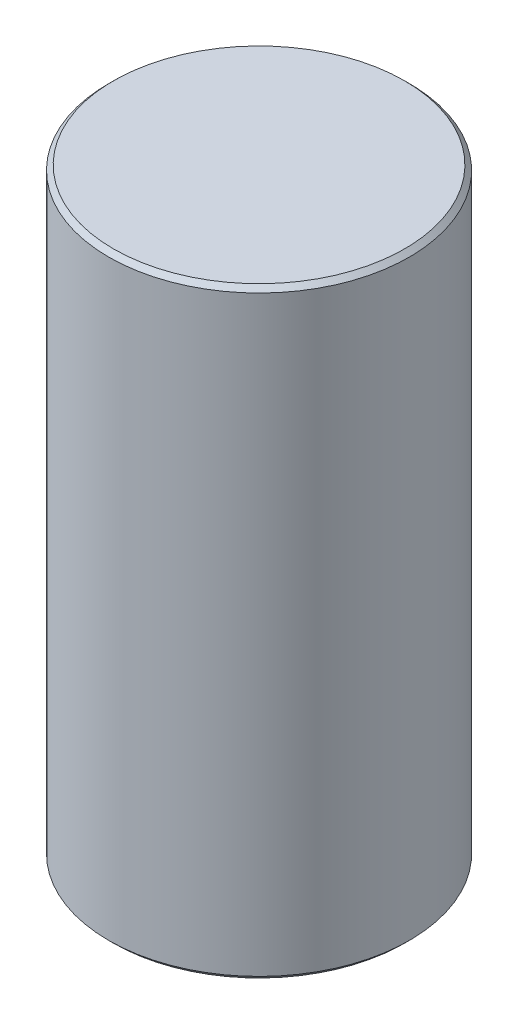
ISO-10303-21;
HEADER;
FILE_DESCRIPTION(('STEP AP214'),'2;1');
FILE_NAME('part.step','',(''),(''),'','','');
FILE_SCHEMA(('AUTOMOTIVE_DESIGN { 1 0 10303 214 1 1 1 1 }'));
ENDSEC;
DATA;
#1=APPLICATION_CONTEXT('core data for automotive mechanical design processes');
#2=APPLICATION_PROTOCOL_DEFINITION('international standard','automotive_design',2000,#1);
#3=PRODUCT_CONTEXT('',#1,'mechanical');
#4=PRODUCT('Part','Part','',(#3));
#5=PRODUCT_RELATED_PRODUCT_CATEGORY('part','',(#4));
#6=PRODUCT_DEFINITION_FORMATION('','',#4);
#7=PRODUCT_DEFINITION_CONTEXT('part definition',#1,'design');
#8=PRODUCT_DEFINITION('design','',#6,#7);
#9=PRODUCT_DEFINITION_SHAPE('','',#8);
#10=(LENGTH_UNIT() NAMED_UNIT(*) SI_UNIT(.MILLI.,.METRE.));
#11=(NAMED_UNIT(*) PLANE_ANGLE_UNIT() SI_UNIT($,.RADIAN.));
#12=(NAMED_UNIT(*) SI_UNIT($,.STERADIAN.) SOLID_ANGLE_UNIT());
#13=UNCERTAINTY_MEASURE_WITH_UNIT(LENGTH_MEASURE(1.E-05),#10,'distance_accuracy_value','');
#14=(GEOMETRIC_REPRESENTATION_CONTEXT(3) GLOBAL_UNCERTAINTY_ASSIGNED_CONTEXT((#13)) GLOBAL_UNIT_ASSIGNED_CONTEXT((#10,
#11,#12)) REPRESENTATION_CONTEXT('',''));
#15=CARTESIAN_POINT('',(0.,0.,0.));
#16=DIRECTION('',(0.,0.,1.));
#17=DIRECTION('',(1.,0.,0.));
#18=AXIS2_PLACEMENT_3D('',#15,#16,#17);
#19=CARTESIAN_POINT('',(0.,-12.7,0.));
#20=DIRECTION('',(0.,1.,0.));
#21=DIRECTION('',(0.,0.,1.));
#22=AXIS2_PLACEMENT_3D('',#19,#20,#21);
#23=CYLINDRICAL_SURFACE('',#22,3.175);
#24=CARTESIAN_POINT('',(0.,-12.6,0.));
#25=DIRECTION('',(0.,1.,0.));
#26=DIRECTION('',(0.,0.,1.));
#27=AXIS2_PLACEMENT_3D('',#24,#25,#26);
#28=CIRCLE('',#27,3.175);
#29=CARTESIAN_POINT('',(0.,-12.6,3.175));
#30=VERTEX_POINT('',#29);
#31=EDGE_CURVE('E40',#30,#30,#28,.T.);
#32=ORIENTED_EDGE('',*,*,#31,.T.);
#33=EDGE_LOOP('',(#32));
#34=FACE_BOUND('',#33,.T.);
#35=CARTESIAN_POINT('',(0.,-0.100000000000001,0.));
#36=DIRECTION('',(0.,1.,0.));
#37=DIRECTION('',(0.,0.,1.));
#38=AXIS2_PLACEMENT_3D('',#35,#36,#37);
#39=CIRCLE('',#38,3.175);
#40=CARTESIAN_POINT('',(0.,-0.100000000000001,3.175));
#41=VERTEX_POINT('',#40);
#42=EDGE_CURVE('E44',#41,#41,#39,.F.);
#43=ORIENTED_EDGE('',*,*,#42,.T.);
#44=EDGE_LOOP('',(#43));
#45=FACE_BOUND('',#44,.T.);
#46=ADVANCED_FACE('F29',(#34,#45),#23,.T.);
#47=CARTESIAN_POINT('',(0.,-12.7,0.));
#48=DIRECTION('',(0.,1.,0.));
#49=DIRECTION('',(0.,0.,1.));
#50=AXIS2_PLACEMENT_3D('',#47,#48,#49);
#51=PLANE('',#50);
#52=CARTESIAN_POINT('',(0.,-12.7,0.));
#53=DIRECTION('',(0.,1.,0.));
#54=DIRECTION('',(0.,0.,1.));
#55=AXIS2_PLACEMENT_3D('',#52,#53,#54);
#56=CIRCLE('',#55,3.075);
#57=CARTESIAN_POINT('',(0.,-12.7,3.075));
#58=VERTEX_POINT('',#57);
#59=EDGE_CURVE('E36',#58,#58,#56,.F.);
#60=ORIENTED_EDGE('',*,*,#59,.T.);
#61=EDGE_LOOP('',(#60));
#62=FACE_BOUND('',#61,.T.);
#63=ADVANCED_FACE('F60',(#62),#51,.F.);
#64=CARTESIAN_POINT('',(0.,0.,0.));
#65=DIRECTION('',(0.,1.,0.));
#66=DIRECTION('',(0.,0.,1.));
#67=AXIS2_PLACEMENT_3D('',#64,#65,#66);
#68=PLANE('',#67);
#69=CARTESIAN_POINT('',(0.,0.,0.));
#70=DIRECTION('',(0.,1.,0.));
#71=DIRECTION('',(0.,0.,1.));
#72=AXIS2_PLACEMENT_3D('',#69,#70,#71);
#73=CIRCLE('',#72,3.075);
#74=CARTESIAN_POINT('',(0.,0.,3.075));
#75=VERTEX_POINT('',#74);
#76=EDGE_CURVE('E10',#75,#75,#73,.T.);
#77=ORIENTED_EDGE('',*,*,#76,.T.);
#78=EDGE_LOOP('',(#77));
#79=FACE_BOUND('',#78,.T.);
#80=ADVANCED_FACE('F57',(#79),#68,.T.);
#81=CARTESIAN_POINT('',(0.,-12.6,0.));
#82=DIRECTION('',(0.,1.,0.));
#83=DIRECTION('',(0.,0.,1.));
#84=AXIS2_PLACEMENT_3D('',#81,#82,#83);
#85=CONICAL_SURFACE('',#84,3.175,0.785398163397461);
#86=ORIENTED_EDGE('',*,*,#59,.F.);
#87=EDGE_LOOP('',(#86));
#88=FACE_BOUND('',#87,.T.);
#89=ORIENTED_EDGE('',*,*,#31,.F.);
#90=EDGE_LOOP('',(#89));
#91=FACE_BOUND('',#90,.T.);
#92=ADVANCED_FACE('F53',(#88,#91),#85,.T.);
#93=CARTESIAN_POINT('',(0.,0.,0.));
#94=DIRECTION('',(0.,-1.,0.));
#95=DIRECTION('',(0.,0.,-1.));
#96=AXIS2_PLACEMENT_3D('',#93,#94,#95);
#97=CONICAL_SURFACE('',#96,3.075,0.785398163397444);
#98=ORIENTED_EDGE('',*,*,#42,.F.);
#99=EDGE_LOOP('',(#98));
#100=FACE_BOUND('',#99,.T.);
#101=ORIENTED_EDGE('',*,*,#76,.F.);
#102=EDGE_LOOP('',(#101));
#103=FACE_BOUND('',#102,.T.);
#104=ADVANCED_FACE('F31',(#100,#103),#97,.T.);
#105=CLOSED_SHELL('',(#46,#63,#80,#92,#104));
#106=MANIFOLD_SOLID_BREP('B2',#105);
#107=ADVANCED_BREP_SHAPE_REPRESENTATION('',(#18,#106),#14);
#108=SHAPE_DEFINITION_REPRESENTATION(#9,#107);
ENDSEC;
END-ISO-10303-21;
